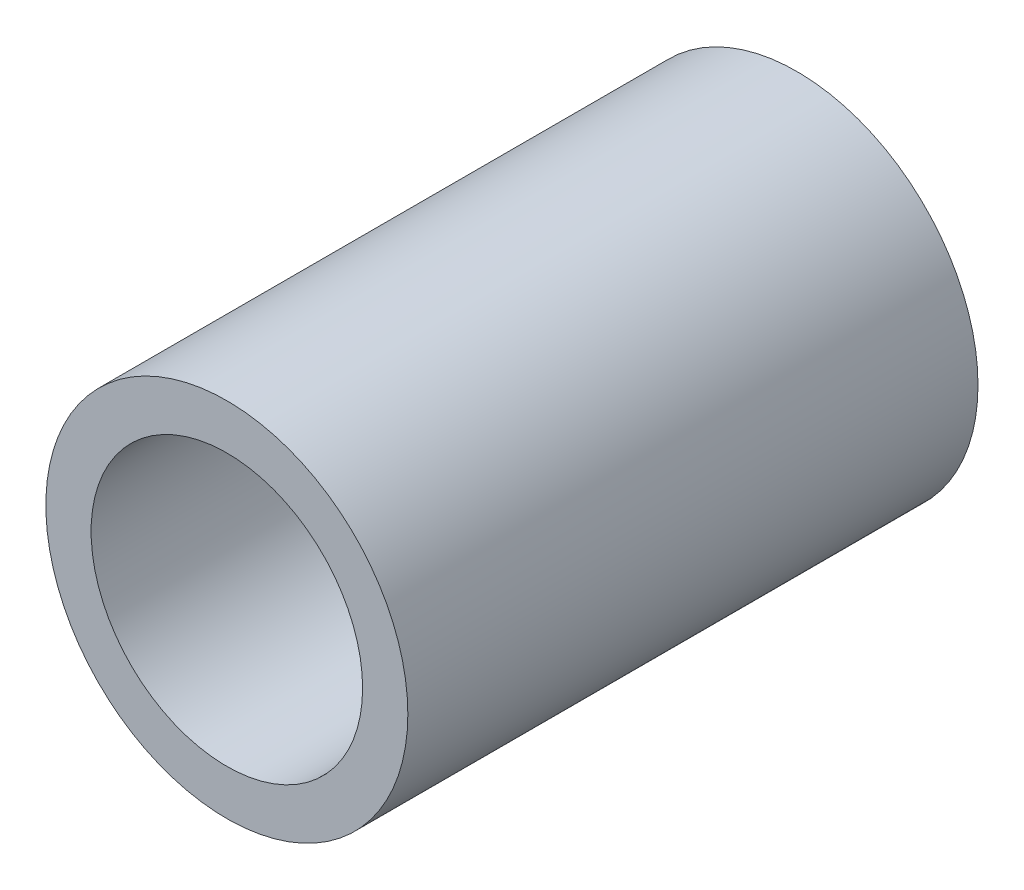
ISO-10303-21;
HEADER;
FILE_DESCRIPTION(('STEP AP214'),'2;1');
FILE_NAME('part.step','',(''),(''),'','','');
FILE_SCHEMA(('AUTOMOTIVE_DESIGN { 1 0 10303 214 1 1 1 1 }'));
ENDSEC;
DATA;
#1=APPLICATION_CONTEXT('core data for automotive mechanical design processes');
#2=APPLICATION_PROTOCOL_DEFINITION('international standard','automotive_design',2000,#1);
#3=PRODUCT_CONTEXT('',#1,'mechanical');
#4=PRODUCT('Part','Part','',(#3));
#5=PRODUCT_RELATED_PRODUCT_CATEGORY('part','',(#4));
#6=PRODUCT_DEFINITION_FORMATION('','',#4);
#7=PRODUCT_DEFINITION_CONTEXT('part definition',#1,'design');
#8=PRODUCT_DEFINITION('design','',#6,#7);
#9=PRODUCT_DEFINITION_SHAPE('','',#8);
#10=(LENGTH_UNIT() NAMED_UNIT(*) SI_UNIT(.MILLI.,.METRE.));
#11=(NAMED_UNIT(*) PLANE_ANGLE_UNIT() SI_UNIT($,.RADIAN.));
#12=(NAMED_UNIT(*) SI_UNIT($,.STERADIAN.) SOLID_ANGLE_UNIT());
#13=UNCERTAINTY_MEASURE_WITH_UNIT(LENGTH_MEASURE(1.E-05),#10,'distance_accuracy_value','');
#14=(GEOMETRIC_REPRESENTATION_CONTEXT(3) GLOBAL_UNCERTAINTY_ASSIGNED_CONTEXT((#13)) GLOBAL_UNIT_ASSIGNED_CONTEXT((#10,
#11,#12)) REPRESENTATION_CONTEXT('',''));
#15=CARTESIAN_POINT('',(0.,0.,0.));
#16=DIRECTION('',(0.,0.,1.));
#17=DIRECTION('',(1.,0.,0.));
#18=AXIS2_PLACEMENT_3D('',#15,#16,#17);
#19=CARTESIAN_POINT('',(0.,0.,31.5));
#20=DIRECTION('',(0.,0.,1.));
#21=DIRECTION('',(1.,0.,0.));
#22=AXIS2_PLACEMENT_3D('',#19,#20,#21);
#23=PLANE('',#22);
#24=CARTESIAN_POINT('',(0.,0.,31.5));
#25=DIRECTION('',(0.,0.,1.));
#26=DIRECTION('',(1.,0.,0.));
#27=AXIS2_PLACEMENT_3D('',#24,#25,#26);
#28=CIRCLE('',#27,10.);
#29=CARTESIAN_POINT('',(10.,0.,31.5));
#30=VERTEX_POINT('',#29);
#31=EDGE_CURVE('E10',#30,#30,#28,.T.);
#32=ORIENTED_EDGE('',*,*,#31,.T.);
#33=EDGE_LOOP('',(#32));
#34=FACE_BOUND('',#33,.T.);
#35=CARTESIAN_POINT('',(0.,0.,31.5));
#36=DIRECTION('',(0.,0.,1.));
#37=DIRECTION('',(1.,0.,0.));
#38=AXIS2_PLACEMENT_3D('',#35,#36,#37);
#39=CIRCLE('',#38,7.5);
#40=CARTESIAN_POINT('',(7.5,0.,31.5));
#41=VERTEX_POINT('',#40);
#42=EDGE_CURVE('E41',#41,#41,#39,.T.);
#43=ORIENTED_EDGE('',*,*,#42,.F.);
#44=EDGE_LOOP('',(#43));
#45=FACE_BOUND('',#44,.T.);
#46=ADVANCED_FACE('F30',(#34,#45),#23,.T.);
#47=CARTESIAN_POINT('',(0.,0.,0.));
#48=DIRECTION('',(0.,0.,1.));
#49=DIRECTION('',(1.,0.,0.));
#50=AXIS2_PLACEMENT_3D('',#47,#48,#49);
#51=PLANE('',#50);
#52=CARTESIAN_POINT('',(0.,0.,0.));
#53=DIRECTION('',(0.,0.,1.));
#54=DIRECTION('',(1.,0.,0.));
#55=AXIS2_PLACEMENT_3D('',#52,#53,#54);
#56=CIRCLE('',#55,10.);
#57=CARTESIAN_POINT('',(10.,0.,0.));
#58=VERTEX_POINT('',#57);
#59=EDGE_CURVE('E34',#58,#58,#56,.T.);
#60=ORIENTED_EDGE('',*,*,#59,.F.);
#61=EDGE_LOOP('',(#60));
#62=FACE_BOUND('',#61,.T.);
#63=CARTESIAN_POINT('',(0.,0.,0.));
#64=DIRECTION('',(0.,0.,1.));
#65=DIRECTION('',(1.,0.,0.));
#66=AXIS2_PLACEMENT_3D('',#63,#64,#65);
#67=CIRCLE('',#66,7.5);
#68=CARTESIAN_POINT('',(7.5,0.,0.));
#69=VERTEX_POINT('',#68);
#70=EDGE_CURVE('E43',#69,#69,#67,.T.);
#71=ORIENTED_EDGE('',*,*,#70,.T.);
#72=EDGE_LOOP('',(#71));
#73=FACE_BOUND('',#72,.T.);
#74=ADVANCED_FACE('F53',(#62,#73),#51,.F.);
#75=CARTESIAN_POINT('',(0.,0.,31.5));
#76=DIRECTION('',(0.,0.,-1.));
#77=DIRECTION('',(-1.,0.,0.));
#78=AXIS2_PLACEMENT_3D('',#75,#76,#77);
#79=CYLINDRICAL_SURFACE('',#78,10.);
#80=ORIENTED_EDGE('',*,*,#31,.F.);
#81=EDGE_LOOP('',(#80));
#82=FACE_BOUND('',#81,.T.);
#83=ORIENTED_EDGE('',*,*,#59,.T.);
#84=EDGE_LOOP('',(#83));
#85=FACE_BOUND('',#84,.T.);
#86=ADVANCED_FACE('F32',(#82,#85),#79,.T.);
#87=CARTESIAN_POINT('',(0.,0.,31.5));
#88=DIRECTION('',(0.,0.,-1.));
#89=DIRECTION('',(-1.,0.,0.));
#90=AXIS2_PLACEMENT_3D('',#87,#88,#89);
#91=CYLINDRICAL_SURFACE('',#90,7.5);
#92=ORIENTED_EDGE('',*,*,#42,.T.);
#93=EDGE_LOOP('',(#92));
#94=FACE_BOUND('',#93,.T.);
#95=ORIENTED_EDGE('',*,*,#70,.F.);
#96=EDGE_LOOP('',(#95));
#97=FACE_BOUND('',#96,.T.);
#98=ADVANCED_FACE('F49',(#94,#97),#91,.F.);
#99=CLOSED_SHELL('',(#46,#74,#86,#98));
#100=MANIFOLD_SOLID_BREP('B2',#99);
#101=ADVANCED_BREP_SHAPE_REPRESENTATION('',(#18,#100),#14);
#102=SHAPE_DEFINITION_REPRESENTATION(#9,#101);
ENDSEC;
END-ISO-10303-21;
